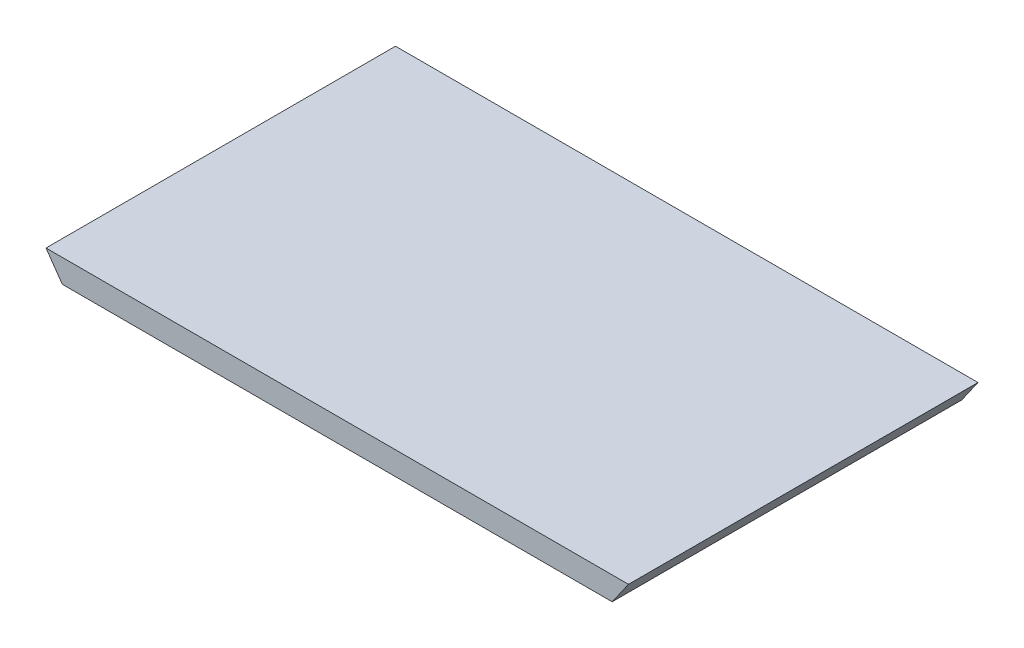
from build123d import *

# Parameters (mm, degrees)
ESQUISSE1_W             = 500
ESQUISSE1_H             = 300
BOSS_EXTRU_1_DEPTH      = 10
ENL_V_MAT_EXTRU_1_REACH = 392.64


with BuildPart() as part:
    # Esquisse1 → Boss.-Extru.1 (new, symmetric)
    with BuildSketch(Plane(origin=(0, 0, 0), x_dir=(1, 0, 0), z_dir=(0, 1, 0))):
        Rectangle(ESQUISSE1_W, ESQUISSE1_H)
    extrude(amount=BOSS_EXTRU_1_DEPTH, both=True)

    # Esquisse2 → Enl_v. mat.-Extru.1 (cut, up to next)
    with BuildSketch(Plane.XY.offset(150), mode=Mode.PRIVATE) as enl_v_mat_extru_1_sk1:
        Polygon((250, 10), (235.995849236, -10), (250, -10), align=None)
    enl_v_mat_extru_1_tool1 = extrude(enl_v_mat_extru_1_sk1.sketch, amount=-ENL_V_MAT_EXTRU_1_REACH, mode=Mode.PRIVATE) & part.part
    # Esquisse2 → Enl_v. mat.-Extru.1 (cut, up to next)
    with BuildSketch(Plane.XY.offset(150), mode=Mode.PRIVATE) as enl_v_mat_extru_1_sk2:
        Polygon((-250, 10), (-235.995849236, -10), (-250, -10), align=None)
    enl_v_mat_extru_1_tool2 = extrude(enl_v_mat_extru_1_sk2.sketch, amount=-ENL_V_MAT_EXTRU_1_REACH, mode=Mode.PRIVATE) & part.part
    add(enl_v_mat_extru_1_tool1.solids().sort_by_distance((245.33195, -3.333333, 150))[0], mode=Mode.SUBTRACT)
    add(enl_v_mat_extru_1_tool2.solids().sort_by_distance((-245.33195, -3.333333, 150))[0], mode=Mode.SUBTRACT)


solid = part.part
